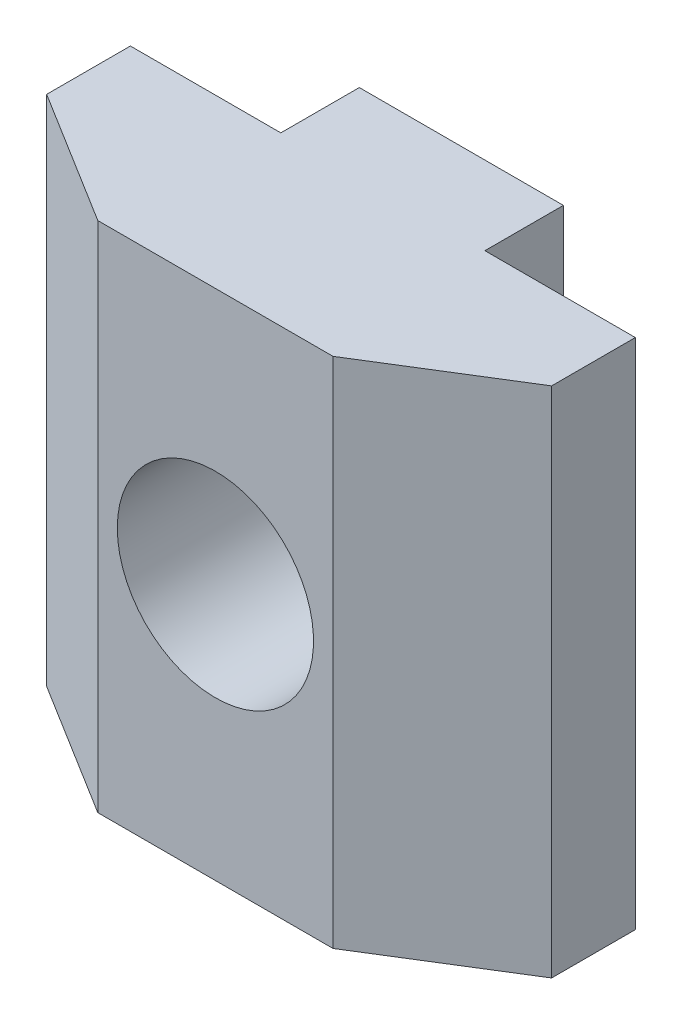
from build123d import *

# Parameters (mm, degrees)
EXTRUDE_1_DEPTH     = 19.6
SKETCH_2_R          = 3.75
CUT_EXTRUDE_1_DEPTH = 24.783239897


with BuildPart() as part:
    # Sketch 1 → Extrude 1 (new body)
    with BuildSketch(Plane(origin=(0, 0, 0), x_dir=(1, 0, 0), z_dir=(0, 1, 0))):
        Polygon((-4.495, 0), (4.495, 0), (9.65, 3.2), (9.65, 6.4), (3.9, 6.4), (3.9, 9.4), (-3.9, 9.4), (-3.9, 6.4), (-9.65, 6.4), (-9.65, 3.2), align=None)
    extrude(amount=EXTRUDE_1_DEPTH)

    # Sketch 2 → Cut-Extrude 1 (cut, through all)
    with BuildSketch(Plane(origin=(0, 0, -9.4), x_dir=(-1, 0, 0), z_dir=(0, 0, -1))):
        with Locations((0, 9.8)):
            Circle(SKETCH_2_R)
    extrude(amount=-CUT_EXTRUDE_1_DEPTH, mode=Mode.SUBTRACT)


solid = part.part
